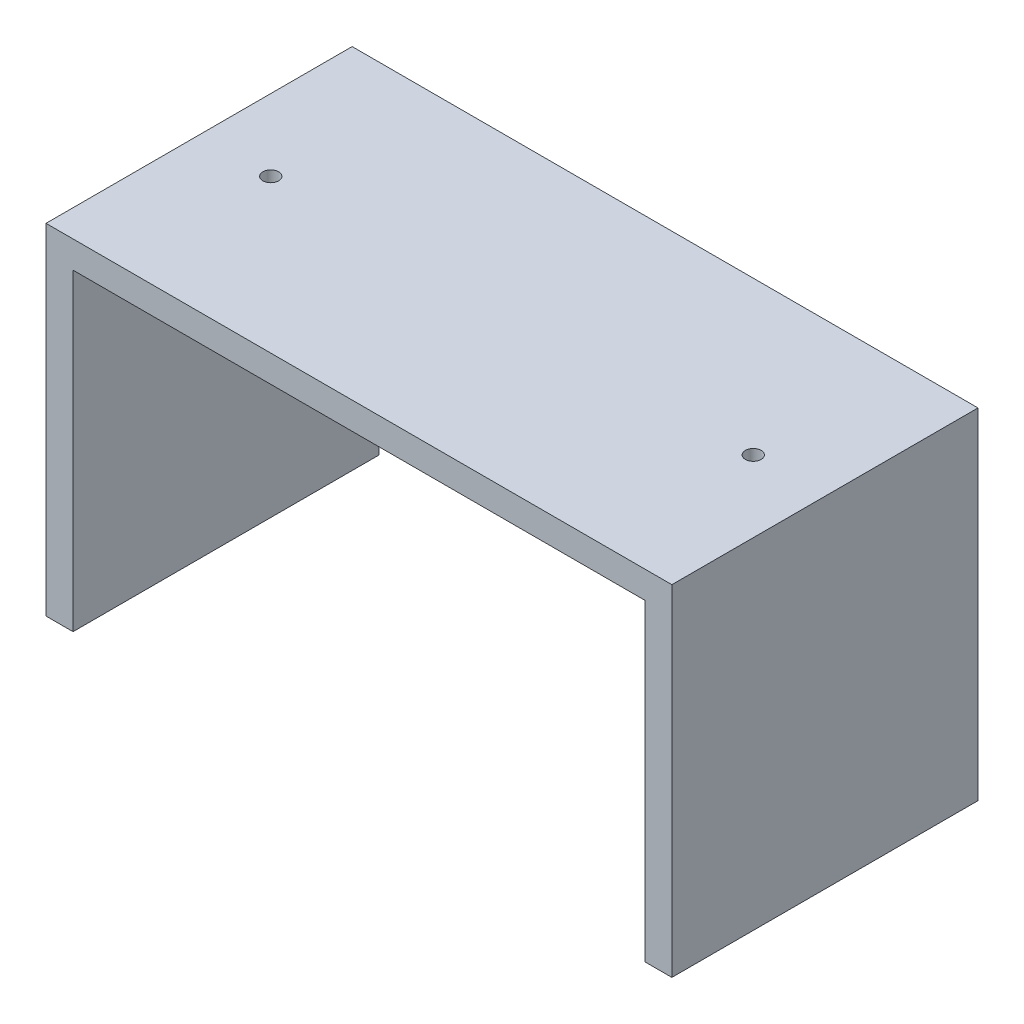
ISO-10303-21;
HEADER;
FILE_DESCRIPTION(('STEP AP214'),'2;1');
FILE_NAME('part.step','',(''),(''),'','','');
FILE_SCHEMA(('AUTOMOTIVE_DESIGN { 1 0 10303 214 1 1 1 1 }'));
ENDSEC;
DATA;
#1=APPLICATION_CONTEXT('core data for automotive mechanical design processes');
#2=APPLICATION_PROTOCOL_DEFINITION('international standard','automotive_design',2000,#1);
#3=PRODUCT_CONTEXT('',#1,'mechanical');
#4=PRODUCT('Part','Part','',(#3));
#5=PRODUCT_RELATED_PRODUCT_CATEGORY('part','',(#4));
#6=PRODUCT_DEFINITION_FORMATION('','',#4);
#7=PRODUCT_DEFINITION_CONTEXT('part definition',#1,'design');
#8=PRODUCT_DEFINITION('design','',#6,#7);
#9=PRODUCT_DEFINITION_SHAPE('','',#8);
#10=(LENGTH_UNIT() NAMED_UNIT(*) SI_UNIT(.MILLI.,.METRE.));
#11=(NAMED_UNIT(*) PLANE_ANGLE_UNIT() SI_UNIT($,.RADIAN.));
#12=(NAMED_UNIT(*) SI_UNIT($,.STERADIAN.) SOLID_ANGLE_UNIT());
#13=UNCERTAINTY_MEASURE_WITH_UNIT(LENGTH_MEASURE(1.E-05),#10,'distance_accuracy_value','');
#14=(GEOMETRIC_REPRESENTATION_CONTEXT(3) GLOBAL_UNCERTAINTY_ASSIGNED_CONTEXT((#13)) GLOBAL_UNIT_ASSIGNED_CONTEXT((#10,
#11,#12)) REPRESENTATION_CONTEXT('',''));
#15=CARTESIAN_POINT('',(0.,0.,0.));
#16=DIRECTION('',(0.,0.,1.));
#17=DIRECTION('',(1.,0.,0.));
#18=AXIS2_PLACEMENT_3D('',#15,#16,#17);
#19=CARTESIAN_POINT('',(0.,-20.,18.));
#20=DIRECTION('',(0.,1.,0.));
#21=DIRECTION('',(0.,0.,1.));
#22=AXIS2_PLACEMENT_3D('',#19,#20,#21);
#23=PLANE('',#22);
#24=DIRECTION('',(1.,0.,0.));
#25=VECTOR('',#24,1.);
#26=CARTESIAN_POINT('',(0.,-20.,0.));
#27=LINE('',#26,#25);
#28=CARTESIAN_POINT('',(0.,-20.,0.));
#29=VERTEX_POINT('',#28);
#30=CARTESIAN_POINT('',(1.59,-20.,0.));
#31=VERTEX_POINT('',#30);
#32=EDGE_CURVE('E130',#29,#31,#27,.T.);
#33=ORIENTED_EDGE('',*,*,#32,.T.);
#34=DIRECTION('',(0.,0.,-1.));
#35=VECTOR('',#34,1.);
#36=CARTESIAN_POINT('',(1.59,-20.,18.));
#37=LINE('',#36,#35);
#38=CARTESIAN_POINT('',(1.59,-20.,18.));
#39=VERTEX_POINT('',#38);
#40=EDGE_CURVE('E11',#39,#31,#37,.T.);
#41=ORIENTED_EDGE('',*,*,#40,.F.);
#42=DIRECTION('',(1.,0.,0.));
#43=VECTOR('',#42,1.);
#44=CARTESIAN_POINT('',(0.,-20.,18.));
#45=LINE('',#44,#43);
#46=CARTESIAN_POINT('',(0.,-20.,18.));
#47=VERTEX_POINT('',#46);
#48=EDGE_CURVE('E145',#47,#39,#45,.T.);
#49=ORIENTED_EDGE('',*,*,#48,.F.);
#50=DIRECTION('',(0.,0.,-1.));
#51=VECTOR('',#50,1.);
#52=CARTESIAN_POINT('',(0.,-20.,18.));
#53=LINE('',#52,#51);
#54=EDGE_CURVE('E126',#47,#29,#53,.T.);
#55=ORIENTED_EDGE('',*,*,#54,.T.);
#56=EDGE_LOOP('',(#33,#41,#49,#55));
#57=FACE_BOUND('',#56,.T.);
#58=ADVANCED_FACE('F34',(#57),#23,.F.);
#59=CARTESIAN_POINT('',(1.59,-20.,18.));
#60=DIRECTION('',(-1.,0.,0.));
#61=DIRECTION('',(0.,0.,1.));
#62=AXIS2_PLACEMENT_3D('',#59,#60,#61);
#63=PLANE('',#62);
#64=DIRECTION('',(0.,1.,0.));
#65=VECTOR('',#64,1.);
#66=CARTESIAN_POINT('',(1.59,-20.,0.));
#67=LINE('',#66,#65);
#68=CARTESIAN_POINT('',(1.59,-1.59,0.));
#69=VERTEX_POINT('',#68);
#70=EDGE_CURVE('E133',#31,#69,#67,.T.);
#71=ORIENTED_EDGE('',*,*,#70,.T.);
#72=DIRECTION('',(0.,0.,-1.));
#73=VECTOR('',#72,1.);
#74=CARTESIAN_POINT('',(1.59,-1.59,18.));
#75=LINE('',#74,#73);
#76=CARTESIAN_POINT('',(1.59,-1.59,18.));
#77=VERTEX_POINT('',#76);
#78=EDGE_CURVE('E42',#77,#69,#75,.T.);
#79=ORIENTED_EDGE('',*,*,#78,.F.);
#80=DIRECTION('',(0.,1.,0.));
#81=VECTOR('',#80,1.);
#82=CARTESIAN_POINT('',(1.59,-20.,18.));
#83=LINE('',#82,#81);
#84=EDGE_CURVE('E93',#39,#77,#83,.T.);
#85=ORIENTED_EDGE('',*,*,#84,.F.);
#86=ORIENTED_EDGE('',*,*,#40,.T.);
#87=EDGE_LOOP('',(#71,#79,#85,#86));
#88=FACE_BOUND('',#87,.T.);
#89=ADVANCED_FACE('F206',(#88),#63,.F.);
#90=CARTESIAN_POINT('',(1.59,-1.59,18.));
#91=DIRECTION('',(0.,1.,0.));
#92=DIRECTION('',(0.,0.,1.));
#93=AXIS2_PLACEMENT_3D('',#90,#91,#92);
#94=PLANE('',#93);
#95=CARTESIAN_POINT('',(32.5859,-1.59,9.));
#96=DIRECTION('',(0.,1.,0.));
#97=DIRECTION('',(0.,0.,1.));
#98=AXIS2_PLACEMENT_3D('',#95,#96,#97);
#99=CIRCLE('',#98,0.463549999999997);
#100=CARTESIAN_POINT('',(32.5859,-1.59,9.46355));
#101=VERTEX_POINT('',#100);
#102=EDGE_CURVE('E183',#101,#101,#99,.T.);
#103=ORIENTED_EDGE('',*,*,#102,.T.);
#104=EDGE_LOOP('',(#103));
#105=FACE_BOUND('',#104,.T.);
#106=CARTESIAN_POINT('',(4.2141,-1.59,9.));
#107=DIRECTION('',(0.,1.,0.));
#108=DIRECTION('',(0.,0.,1.));
#109=AXIS2_PLACEMENT_3D('',#106,#107,#108);
#110=CIRCLE('',#109,0.46355);
#111=CARTESIAN_POINT('',(4.2141,-1.59,9.46355));
#112=VERTEX_POINT('',#111);
#113=EDGE_CURVE('E134',#112,#112,#110,.T.);
#114=ORIENTED_EDGE('',*,*,#113,.T.);
#115=EDGE_LOOP('',(#114));
#116=FACE_BOUND('',#115,.T.);
#117=DIRECTION('',(1.,0.,0.));
#118=VECTOR('',#117,1.);
#119=CARTESIAN_POINT('',(1.59,-1.59,0.));
#120=LINE('',#119,#118);
#121=CARTESIAN_POINT('',(35.21,-1.59,0.));
#122=VERTEX_POINT('',#121);
#123=EDGE_CURVE('E136',#69,#122,#120,.T.);
#124=ORIENTED_EDGE('',*,*,#123,.T.);
#125=DIRECTION('',(0.,0.,-1.));
#126=VECTOR('',#125,1.);
#127=CARTESIAN_POINT('',(35.21,-1.59,18.));
#128=LINE('',#127,#126);
#129=CARTESIAN_POINT('',(35.21,-1.59,18.));
#130=VERTEX_POINT('',#129);
#131=EDGE_CURVE('E152',#130,#122,#128,.T.);
#132=ORIENTED_EDGE('',*,*,#131,.F.);
#133=DIRECTION('',(1.,0.,0.));
#134=VECTOR('',#133,1.);
#135=CARTESIAN_POINT('',(1.59,-1.59,18.));
#136=LINE('',#135,#134);
#137=EDGE_CURVE('E160',#77,#130,#136,.T.);
#138=ORIENTED_EDGE('',*,*,#137,.F.);
#139=ORIENTED_EDGE('',*,*,#78,.T.);
#140=EDGE_LOOP('',(#124,#132,#138,#139));
#141=FACE_BOUND('',#140,.T.);
#142=ADVANCED_FACE('F158',(#105,#116,#141),#94,.F.);
#143=CARTESIAN_POINT('',(35.21,-1.59,18.));
#144=DIRECTION('',(1.,0.,0.));
#145=DIRECTION('',(0.,0.,-1.));
#146=AXIS2_PLACEMENT_3D('',#143,#144,#145);
#147=PLANE('',#146);
#148=DIRECTION('',(0.,-1.,0.));
#149=VECTOR('',#148,1.);
#150=CARTESIAN_POINT('',(35.21,-1.59,0.));
#151=LINE('',#150,#149);
#152=CARTESIAN_POINT('',(35.21,-20.,0.));
#153=VERTEX_POINT('',#152);
#154=EDGE_CURVE('E138',#122,#153,#151,.T.);
#155=ORIENTED_EDGE('',*,*,#154,.T.);
#156=DIRECTION('',(0.,0.,-1.));
#157=VECTOR('',#156,1.);
#158=CARTESIAN_POINT('',(35.21,-20.,18.));
#159=LINE('',#158,#157);
#160=CARTESIAN_POINT('',(35.21,-20.,18.));
#161=VERTEX_POINT('',#160);
#162=EDGE_CURVE('E149',#161,#153,#159,.T.);
#163=ORIENTED_EDGE('',*,*,#162,.F.);
#164=DIRECTION('',(0.,-1.,0.));
#165=VECTOR('',#164,1.);
#166=CARTESIAN_POINT('',(35.21,-1.59,18.));
#167=LINE('',#166,#165);
#168=EDGE_CURVE('E172',#130,#161,#167,.T.);
#169=ORIENTED_EDGE('',*,*,#168,.F.);
#170=ORIENTED_EDGE('',*,*,#131,.T.);
#171=EDGE_LOOP('',(#155,#163,#169,#170));
#172=FACE_BOUND('',#171,.T.);
#173=ADVANCED_FACE('F168',(#172),#147,.F.);
#174=CARTESIAN_POINT('',(35.21,-20.,18.));
#175=DIRECTION('',(0.,1.,0.));
#176=DIRECTION('',(0.,0.,1.));
#177=AXIS2_PLACEMENT_3D('',#174,#175,#176);
#178=PLANE('',#177);
#179=DIRECTION('',(1.,0.,0.));
#180=VECTOR('',#179,1.);
#181=CARTESIAN_POINT('',(35.21,-20.,0.));
#182=LINE('',#181,#180);
#183=CARTESIAN_POINT('',(36.8,-20.,0.));
#184=VERTEX_POINT('',#183);
#185=EDGE_CURVE('E140',#153,#184,#182,.T.);
#186=ORIENTED_EDGE('',*,*,#185,.T.);
#187=DIRECTION('',(0.,0.,-1.));
#188=VECTOR('',#187,1.);
#189=CARTESIAN_POINT('',(36.8,-20.,18.));
#190=LINE('',#189,#188);
#191=CARTESIAN_POINT('',(36.8,-20.,18.));
#192=VERTEX_POINT('',#191);
#193=EDGE_CURVE('E121',#192,#184,#190,.T.);
#194=ORIENTED_EDGE('',*,*,#193,.F.);
#195=DIRECTION('',(1.,0.,0.));
#196=VECTOR('',#195,1.);
#197=CARTESIAN_POINT('',(35.21,-20.,18.));
#198=LINE('',#197,#196);
#199=EDGE_CURVE('E112',#161,#192,#198,.T.);
#200=ORIENTED_EDGE('',*,*,#199,.F.);
#201=ORIENTED_EDGE('',*,*,#162,.T.);
#202=EDGE_LOOP('',(#186,#194,#200,#201));
#203=FACE_BOUND('',#202,.T.);
#204=ADVANCED_FACE('F171',(#203),#178,.F.);
#205=CARTESIAN_POINT('',(36.8,0.,18.));
#206=DIRECTION('',(-1.,0.,0.));
#207=DIRECTION('',(0.,0.,1.));
#208=AXIS2_PLACEMENT_3D('',#205,#206,#207);
#209=PLANE('',#208);
#210=DIRECTION('',(0.,1.,0.));
#211=VECTOR('',#210,1.);
#212=CARTESIAN_POINT('',(36.8,0.,0.));
#213=LINE('',#212,#211);
#214=CARTESIAN_POINT('',(36.8,0.,0.));
#215=VERTEX_POINT('',#214);
#216=EDGE_CURVE('E120',#184,#215,#213,.T.);
#217=ORIENTED_EDGE('',*,*,#216,.T.);
#218=DIRECTION('',(0.,0.,-1.));
#219=VECTOR('',#218,1.);
#220=CARTESIAN_POINT('',(36.8,0.,18.));
#221=LINE('',#220,#219);
#222=CARTESIAN_POINT('',(36.8,0.,18.));
#223=VERTEX_POINT('',#222);
#224=EDGE_CURVE('E117',#223,#215,#221,.T.);
#225=ORIENTED_EDGE('',*,*,#224,.F.);
#226=DIRECTION('',(0.,1.,0.));
#227=VECTOR('',#226,1.);
#228=CARTESIAN_POINT('',(36.8,0.,18.));
#229=LINE('',#228,#227);
#230=EDGE_CURVE('E106',#192,#223,#229,.T.);
#231=ORIENTED_EDGE('',*,*,#230,.F.);
#232=ORIENTED_EDGE('',*,*,#193,.T.);
#233=EDGE_LOOP('',(#217,#225,#231,#232));
#234=FACE_BOUND('',#233,.T.);
#235=ADVANCED_FACE('F118',(#234),#209,.F.);
#236=CARTESIAN_POINT('',(0.,0.,18.));
#237=DIRECTION('',(0.,-1.,0.));
#238=DIRECTION('',(0.,0.,-1.));
#239=AXIS2_PLACEMENT_3D('',#236,#237,#238);
#240=PLANE('',#239);
#241=CARTESIAN_POINT('',(32.5859,0.,9.));
#242=DIRECTION('',(0.,1.,0.));
#243=DIRECTION('',(0.,0.,1.));
#244=AXIS2_PLACEMENT_3D('',#241,#242,#243);
#245=CIRCLE('',#244,0.463549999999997);
#246=CARTESIAN_POINT('',(32.5859,0.,9.46355));
#247=VERTEX_POINT('',#246);
#248=EDGE_CURVE('E186',#247,#247,#245,.T.);
#249=ORIENTED_EDGE('',*,*,#248,.F.);
#250=EDGE_LOOP('',(#249));
#251=FACE_BOUND('',#250,.T.);
#252=CARTESIAN_POINT('',(4.2141,0.,9.));
#253=DIRECTION('',(0.,1.,0.));
#254=DIRECTION('',(0.,0.,1.));
#255=AXIS2_PLACEMENT_3D('',#252,#253,#254);
#256=CIRCLE('',#255,0.46355);
#257=CARTESIAN_POINT('',(4.2141,0.,9.46355));
#258=VERTEX_POINT('',#257);
#259=EDGE_CURVE('E180',#258,#258,#256,.T.);
#260=ORIENTED_EDGE('',*,*,#259,.F.);
#261=EDGE_LOOP('',(#260));
#262=FACE_BOUND('',#261,.T.);
#263=DIRECTION('',(-1.,0.,0.));
#264=VECTOR('',#263,1.);
#265=CARTESIAN_POINT('',(0.,0.,0.));
#266=LINE('',#265,#264);
#267=CARTESIAN_POINT('',(0.,0.,0.));
#268=VERTEX_POINT('',#267);
#269=EDGE_CURVE('E79',#215,#268,#266,.T.);
#270=ORIENTED_EDGE('',*,*,#269,.T.);
#271=DIRECTION('',(0.,0.,-1.));
#272=VECTOR('',#271,1.);
#273=CARTESIAN_POINT('',(0.,0.,18.));
#274=LINE('',#273,#272);
#275=CARTESIAN_POINT('',(0.,0.,18.));
#276=VERTEX_POINT('',#275);
#277=EDGE_CURVE('E122',#276,#268,#274,.T.);
#278=ORIENTED_EDGE('',*,*,#277,.F.);
#279=DIRECTION('',(-1.,0.,0.));
#280=VECTOR('',#279,1.);
#281=CARTESIAN_POINT('',(0.,0.,18.));
#282=LINE('',#281,#280);
#283=EDGE_CURVE('E110',#223,#276,#282,.T.);
#284=ORIENTED_EDGE('',*,*,#283,.F.);
#285=ORIENTED_EDGE('',*,*,#224,.T.);
#286=EDGE_LOOP('',(#270,#278,#284,#285));
#287=FACE_BOUND('',#286,.T.);
#288=ADVANCED_FACE('F124',(#251,#262,#287),#240,.F.);
#289=CARTESIAN_POINT('',(0.,-20.,18.));
#290=DIRECTION('',(1.,0.,0.));
#291=DIRECTION('',(0.,0.,-1.));
#292=AXIS2_PLACEMENT_3D('',#289,#290,#291);
#293=PLANE('',#292);
#294=DIRECTION('',(0.,-1.,0.));
#295=VECTOR('',#294,1.);
#296=CARTESIAN_POINT('',(0.,-20.,0.));
#297=LINE('',#296,#295);
#298=EDGE_CURVE('E85',#268,#29,#297,.T.);
#299=ORIENTED_EDGE('',*,*,#298,.T.);
#300=ORIENTED_EDGE('',*,*,#54,.F.);
#301=DIRECTION('',(0.,-1.,0.));
#302=VECTOR('',#301,1.);
#303=CARTESIAN_POINT('',(0.,-20.,18.));
#304=LINE('',#303,#302);
#305=EDGE_CURVE('E50',#276,#47,#304,.T.);
#306=ORIENTED_EDGE('',*,*,#305,.F.);
#307=ORIENTED_EDGE('',*,*,#277,.T.);
#308=EDGE_LOOP('',(#299,#300,#306,#307));
#309=FACE_BOUND('',#308,.T.);
#310=ADVANCED_FACE('F195',(#309),#293,.F.);
#311=CARTESIAN_POINT('',(0.,0.,18.));
#312=DIRECTION('',(0.,0.,1.));
#313=DIRECTION('',(1.,0.,0.));
#314=AXIS2_PLACEMENT_3D('',#311,#312,#313);
#315=PLANE('',#314);
#316=ORIENTED_EDGE('',*,*,#48,.T.);
#317=ORIENTED_EDGE('',*,*,#84,.T.);
#318=ORIENTED_EDGE('',*,*,#137,.T.);
#319=ORIENTED_EDGE('',*,*,#168,.T.);
#320=ORIENTED_EDGE('',*,*,#199,.T.);
#321=ORIENTED_EDGE('',*,*,#230,.T.);
#322=ORIENTED_EDGE('',*,*,#283,.T.);
#323=ORIENTED_EDGE('',*,*,#305,.T.);
#324=EDGE_LOOP('',(#316,#317,#318,#319,#320,#321,#322,#323));
#325=FACE_BOUND('',#324,.T.);
#326=ADVANCED_FACE('F108',(#325),#315,.T.);
#327=CARTESIAN_POINT('',(0.,0.,0.));
#328=DIRECTION('',(0.,0.,1.));
#329=DIRECTION('',(1.,0.,0.));
#330=AXIS2_PLACEMENT_3D('',#327,#328,#329);
#331=PLANE('',#330);
#332=ORIENTED_EDGE('',*,*,#32,.F.);
#333=ORIENTED_EDGE('',*,*,#298,.F.);
#334=ORIENTED_EDGE('',*,*,#269,.F.);
#335=ORIENTED_EDGE('',*,*,#216,.F.);
#336=ORIENTED_EDGE('',*,*,#185,.F.);
#337=ORIENTED_EDGE('',*,*,#154,.F.);
#338=ORIENTED_EDGE('',*,*,#123,.F.);
#339=ORIENTED_EDGE('',*,*,#70,.F.);
#340=EDGE_LOOP('',(#332,#333,#334,#335,#336,#337,#338,#339));
#341=FACE_BOUND('',#340,.T.);
#342=ADVANCED_FACE('F164',(#341),#331,.F.);
#343=CARTESIAN_POINT('',(4.2141,-10.,9.));
#344=DIRECTION('',(0.,1.,0.));
#345=DIRECTION('',(0.,0.,1.));
#346=AXIS2_PLACEMENT_3D('',#343,#344,#345);
#347=CYLINDRICAL_SURFACE('',#346,0.46355);
#348=ORIENTED_EDGE('',*,*,#259,.T.);
#349=EDGE_LOOP('',(#348));
#350=FACE_BOUND('',#349,.T.);
#351=ORIENTED_EDGE('',*,*,#113,.F.);
#352=EDGE_LOOP('',(#351));
#353=FACE_BOUND('',#352,.T.);
#354=ADVANCED_FACE('F199',(#350,#353),#347,.F.);
#355=CARTESIAN_POINT('',(32.5859,-10.,9.));
#356=DIRECTION('',(0.,1.,0.));
#357=DIRECTION('',(0.,0.,1.));
#358=AXIS2_PLACEMENT_3D('',#355,#356,#357);
#359=CYLINDRICAL_SURFACE('',#358,0.463549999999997);
#360=ORIENTED_EDGE('',*,*,#248,.T.);
#361=EDGE_LOOP('',(#360));
#362=FACE_BOUND('',#361,.T.);
#363=ORIENTED_EDGE('',*,*,#102,.F.);
#364=EDGE_LOOP('',(#363));
#365=FACE_BOUND('',#364,.T.);
#366=ADVANCED_FACE('F190',(#362,#365),#359,.F.);
#367=CLOSED_SHELL('',(#58,#89,#142,#173,#204,#235,#288,#310,#326,#342,#354,#366));
#368=MANIFOLD_SOLID_BREP('B2',#367);
#369=ADVANCED_BREP_SHAPE_REPRESENTATION('',(#18,#368),#14);
#370=SHAPE_DEFINITION_REPRESENTATION(#9,#369);
ENDSEC;
END-ISO-10303-21;
